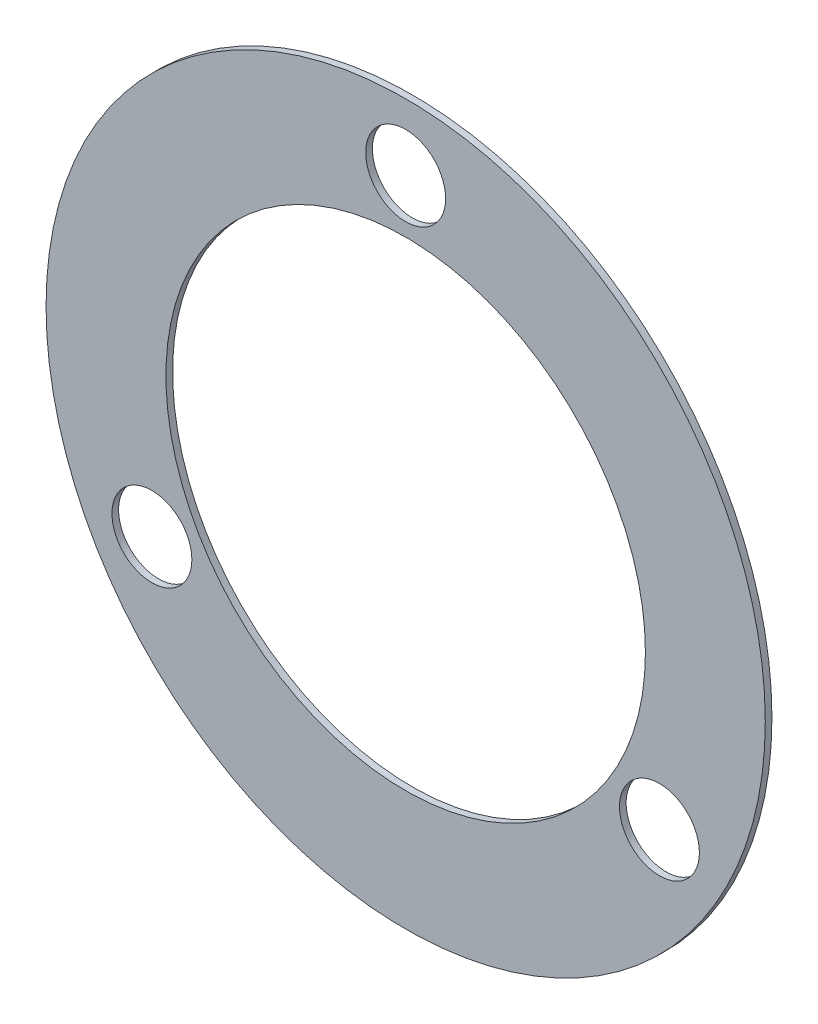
ISO-10303-21;
HEADER;
FILE_DESCRIPTION(('STEP AP214'),'2;1');
FILE_NAME('part.step','',(''),(''),'','','');
FILE_SCHEMA(('AUTOMOTIVE_DESIGN { 1 0 10303 214 1 1 1 1 }'));
ENDSEC;
DATA;
#1=APPLICATION_CONTEXT('core data for automotive mechanical design processes');
#2=APPLICATION_PROTOCOL_DEFINITION('international standard','automotive_design',2000,#1);
#3=PRODUCT_CONTEXT('',#1,'mechanical');
#4=PRODUCT('Part','Part','',(#3));
#5=PRODUCT_RELATED_PRODUCT_CATEGORY('part','',(#4));
#6=PRODUCT_DEFINITION_FORMATION('','',#4);
#7=PRODUCT_DEFINITION_CONTEXT('part definition',#1,'design');
#8=PRODUCT_DEFINITION('design','',#6,#7);
#9=PRODUCT_DEFINITION_SHAPE('','',#8);
#10=(LENGTH_UNIT() NAMED_UNIT(*) SI_UNIT(.MILLI.,.METRE.));
#11=(NAMED_UNIT(*) PLANE_ANGLE_UNIT() SI_UNIT($,.RADIAN.));
#12=(NAMED_UNIT(*) SI_UNIT($,.STERADIAN.) SOLID_ANGLE_UNIT());
#13=UNCERTAINTY_MEASURE_WITH_UNIT(LENGTH_MEASURE(1.E-05),#10,'distance_accuracy_value','');
#14=(GEOMETRIC_REPRESENTATION_CONTEXT(3) GLOBAL_UNCERTAINTY_ASSIGNED_CONTEXT((#13)) GLOBAL_UNIT_ASSIGNED_CONTEXT((#10,
#11,#12)) REPRESENTATION_CONTEXT('',''));
#15=CARTESIAN_POINT('',(0.,0.,0.));
#16=DIRECTION('',(0.,0.,1.));
#17=DIRECTION('',(1.,0.,0.));
#18=AXIS2_PLACEMENT_3D('',#15,#16,#17);
#19=CARTESIAN_POINT('',(0.,0.,0.5));
#20=DIRECTION('',(0.,0.,1.));
#21=DIRECTION('',(1.,0.,0.));
#22=AXIS2_PLACEMENT_3D('',#19,#20,#21);
#23=PLANE('',#22);
#24=CARTESIAN_POINT('',(0.,22.,0.5));
#25=DIRECTION('',(0.,0.,1.));
#26=DIRECTION('',(1.,0.,0.));
#27=AXIS2_PLACEMENT_3D('',#24,#25,#26);
#28=CIRCLE('',#27,3.);
#29=CARTESIAN_POINT('',(3.,22.,0.5));
#30=VERTEX_POINT('',#29);
#31=EDGE_CURVE('E50',#30,#30,#28,.T.);
#32=ORIENTED_EDGE('',*,*,#31,.F.);
#33=EDGE_LOOP('',(#32));
#34=FACE_BOUND('',#33,.T.);
#35=CARTESIAN_POINT('',(19.0525588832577,-10.9999999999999,0.5));
#36=DIRECTION('',(0.,0.,1.));
#37=DIRECTION('',(1.,0.,0.));
#38=AXIS2_PLACEMENT_3D('',#35,#36,#37);
#39=CIRCLE('',#38,3.);
#40=CARTESIAN_POINT('',(22.0525588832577,-10.9999999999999,0.5));
#41=VERTEX_POINT('',#40);
#42=EDGE_CURVE('E35',#41,#41,#39,.T.);
#43=ORIENTED_EDGE('',*,*,#42,.F.);
#44=EDGE_LOOP('',(#43));
#45=FACE_BOUND('',#44,.T.);
#46=CARTESIAN_POINT('',(0.,0.,0.5));
#47=DIRECTION('',(0.,0.,1.));
#48=DIRECTION('',(1.,0.,0.));
#49=AXIS2_PLACEMENT_3D('',#46,#47,#48);
#50=CIRCLE('',#49,27.);
#51=CARTESIAN_POINT('',(27.,0.,0.5));
#52=VERTEX_POINT('',#51);
#53=EDGE_CURVE('E10',#52,#52,#50,.T.);
#54=ORIENTED_EDGE('',*,*,#53,.T.);
#55=EDGE_LOOP('',(#54));
#56=FACE_BOUND('',#55,.T.);
#57=CARTESIAN_POINT('',(-19.0525588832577,-11.,0.5));
#58=DIRECTION('',(0.,0.,1.));
#59=DIRECTION('',(1.,0.,0.));
#60=AXIS2_PLACEMENT_3D('',#57,#58,#59);
#61=CIRCLE('',#60,3.);
#62=CARTESIAN_POINT('',(-16.0525588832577,-11.,0.5));
#63=VERTEX_POINT('',#62);
#64=EDGE_CURVE('E44',#63,#63,#61,.T.);
#65=ORIENTED_EDGE('',*,*,#64,.F.);
#66=EDGE_LOOP('',(#65));
#67=FACE_BOUND('',#66,.T.);
#68=CARTESIAN_POINT('',(0.,0.,0.5));
#69=DIRECTION('',(0.,0.,1.));
#70=DIRECTION('',(1.,0.,0.));
#71=AXIS2_PLACEMENT_3D('',#68,#69,#70);
#72=CIRCLE('',#71,18.);
#73=CARTESIAN_POINT('',(18.,0.,0.5));
#74=VERTEX_POINT('',#73);
#75=EDGE_CURVE('E56',#74,#74,#72,.T.);
#76=ORIENTED_EDGE('',*,*,#75,.F.);
#77=EDGE_LOOP('',(#76));
#78=FACE_BOUND('',#77,.T.);
#79=ADVANCED_FACE('F24',(#34,#45,#56,#67,#78),#23,.T.);
#80=CARTESIAN_POINT('',(0.,0.,0.));
#81=DIRECTION('',(0.,0.,1.));
#82=DIRECTION('',(1.,0.,0.));
#83=AXIS2_PLACEMENT_3D('',#80,#81,#82);
#84=PLANE('',#83);
#85=CARTESIAN_POINT('',(0.,22.,0.));
#86=DIRECTION('',(0.,0.,1.));
#87=DIRECTION('',(1.,0.,0.));
#88=AXIS2_PLACEMENT_3D('',#85,#86,#87);
#89=CIRCLE('',#88,3.);
#90=CARTESIAN_POINT('',(3.,22.,0.));
#91=VERTEX_POINT('',#90);
#92=EDGE_CURVE('E53',#91,#91,#89,.T.);
#93=ORIENTED_EDGE('',*,*,#92,.T.);
#94=EDGE_LOOP('',(#93));
#95=FACE_BOUND('',#94,.T.);
#96=CARTESIAN_POINT('',(19.0525588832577,-10.9999999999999,0.));
#97=DIRECTION('',(0.,0.,1.));
#98=DIRECTION('',(1.,0.,0.));
#99=AXIS2_PLACEMENT_3D('',#96,#97,#98);
#100=CIRCLE('',#99,3.);
#101=CARTESIAN_POINT('',(22.0525588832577,-10.9999999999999,0.));
#102=VERTEX_POINT('',#101);
#103=EDGE_CURVE('E39',#102,#102,#100,.T.);
#104=ORIENTED_EDGE('',*,*,#103,.T.);
#105=EDGE_LOOP('',(#104));
#106=FACE_BOUND('',#105,.T.);
#107=CARTESIAN_POINT('',(0.,0.,0.));
#108=DIRECTION('',(0.,0.,1.));
#109=DIRECTION('',(1.,0.,0.));
#110=AXIS2_PLACEMENT_3D('',#107,#108,#109);
#111=CIRCLE('',#110,27.);
#112=CARTESIAN_POINT('',(27.,0.,0.));
#113=VERTEX_POINT('',#112);
#114=EDGE_CURVE('E31',#113,#113,#111,.T.);
#115=ORIENTED_EDGE('',*,*,#114,.F.);
#116=EDGE_LOOP('',(#115));
#117=FACE_BOUND('',#116,.T.);
#118=CARTESIAN_POINT('',(-19.0525588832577,-11.,0.));
#119=DIRECTION('',(0.,0.,1.));
#120=DIRECTION('',(1.,0.,0.));
#121=AXIS2_PLACEMENT_3D('',#118,#119,#120);
#122=CIRCLE('',#121,3.);
#123=CARTESIAN_POINT('',(-16.0525588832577,-11.,0.));
#124=VERTEX_POINT('',#123);
#125=EDGE_CURVE('E47',#124,#124,#122,.T.);
#126=ORIENTED_EDGE('',*,*,#125,.T.);
#127=EDGE_LOOP('',(#126));
#128=FACE_BOUND('',#127,.T.);
#129=CARTESIAN_POINT('',(0.,0.,0.));
#130=DIRECTION('',(0.,0.,1.));
#131=DIRECTION('',(1.,0.,0.));
#132=AXIS2_PLACEMENT_3D('',#129,#130,#131);
#133=CIRCLE('',#132,18.);
#134=CARTESIAN_POINT('',(18.,0.,0.));
#135=VERTEX_POINT('',#134);
#136=EDGE_CURVE('E59',#135,#135,#133,.T.);
#137=ORIENTED_EDGE('',*,*,#136,.T.);
#138=EDGE_LOOP('',(#137));
#139=FACE_BOUND('',#138,.T.);
#140=ADVANCED_FACE('F63',(#95,#106,#117,#128,#139),#84,.F.);
#141=CARTESIAN_POINT('',(0.,0.,0.5));
#142=DIRECTION('',(0.,0.,-1.));
#143=DIRECTION('',(-1.,0.,0.));
#144=AXIS2_PLACEMENT_3D('',#141,#142,#143);
#145=CYLINDRICAL_SURFACE('',#144,27.);
#146=ORIENTED_EDGE('',*,*,#53,.F.);
#147=EDGE_LOOP('',(#146));
#148=FACE_BOUND('',#147,.T.);
#149=ORIENTED_EDGE('',*,*,#114,.T.);
#150=EDGE_LOOP('',(#149));
#151=FACE_BOUND('',#150,.T.);
#152=ADVANCED_FACE('F26',(#148,#151),#145,.T.);
#153=CARTESIAN_POINT('',(19.0525588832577,-10.9999999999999,0.5));
#154=DIRECTION('',(0.,0.,-1.));
#155=DIRECTION('',(-1.,0.,0.));
#156=AXIS2_PLACEMENT_3D('',#153,#154,#155);
#157=CYLINDRICAL_SURFACE('',#156,3.);
#158=ORIENTED_EDGE('',*,*,#42,.T.);
#159=EDGE_LOOP('',(#158));
#160=FACE_BOUND('',#159,.T.);
#161=ORIENTED_EDGE('',*,*,#103,.F.);
#162=EDGE_LOOP('',(#161));
#163=FACE_BOUND('',#162,.T.);
#164=ADVANCED_FACE('F86',(#160,#163),#157,.F.);
#165=CARTESIAN_POINT('',(-19.0525588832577,-11.,0.5));
#166=DIRECTION('',(0.,0.,-1.));
#167=DIRECTION('',(-1.,0.,0.));
#168=AXIS2_PLACEMENT_3D('',#165,#166,#167);
#169=CYLINDRICAL_SURFACE('',#168,3.);
#170=ORIENTED_EDGE('',*,*,#64,.T.);
#171=EDGE_LOOP('',(#170));
#172=FACE_BOUND('',#171,.T.);
#173=ORIENTED_EDGE('',*,*,#125,.F.);
#174=EDGE_LOOP('',(#173));
#175=FACE_BOUND('',#174,.T.);
#176=ADVANCED_FACE('F73',(#172,#175),#169,.F.);
#177=CARTESIAN_POINT('',(0.,22.,0.5));
#178=DIRECTION('',(0.,0.,-1.));
#179=DIRECTION('',(-1.,0.,0.));
#180=AXIS2_PLACEMENT_3D('',#177,#178,#179);
#181=CYLINDRICAL_SURFACE('',#180,3.);
#182=ORIENTED_EDGE('',*,*,#31,.T.);
#183=EDGE_LOOP('',(#182));
#184=FACE_BOUND('',#183,.T.);
#185=ORIENTED_EDGE('',*,*,#92,.F.);
#186=EDGE_LOOP('',(#185));
#187=FACE_BOUND('',#186,.T.);
#188=ADVANCED_FACE('F67',(#184,#187),#181,.F.);
#189=CARTESIAN_POINT('',(0.,0.,0.5));
#190=DIRECTION('',(0.,0.,-1.));
#191=DIRECTION('',(-1.,0.,0.));
#192=AXIS2_PLACEMENT_3D('',#189,#190,#191);
#193=CYLINDRICAL_SURFACE('',#192,18.);
#194=ORIENTED_EDGE('',*,*,#75,.T.);
#195=EDGE_LOOP('',(#194));
#196=FACE_BOUND('',#195,.T.);
#197=ORIENTED_EDGE('',*,*,#136,.F.);
#198=EDGE_LOOP('',(#197));
#199=FACE_BOUND('',#198,.T.);
#200=ADVANCED_FACE('F65',(#196,#199),#193,.F.);
#201=CLOSED_SHELL('',(#79,#140,#152,#164,#176,#188,#200));
#202=MANIFOLD_SOLID_BREP('B2',#201);
#203=ADVANCED_BREP_SHAPE_REPRESENTATION('',(#18,#202),#14);
#204=SHAPE_DEFINITION_REPRESENTATION(#9,#203);
ENDSEC;
END-ISO-10303-21;
